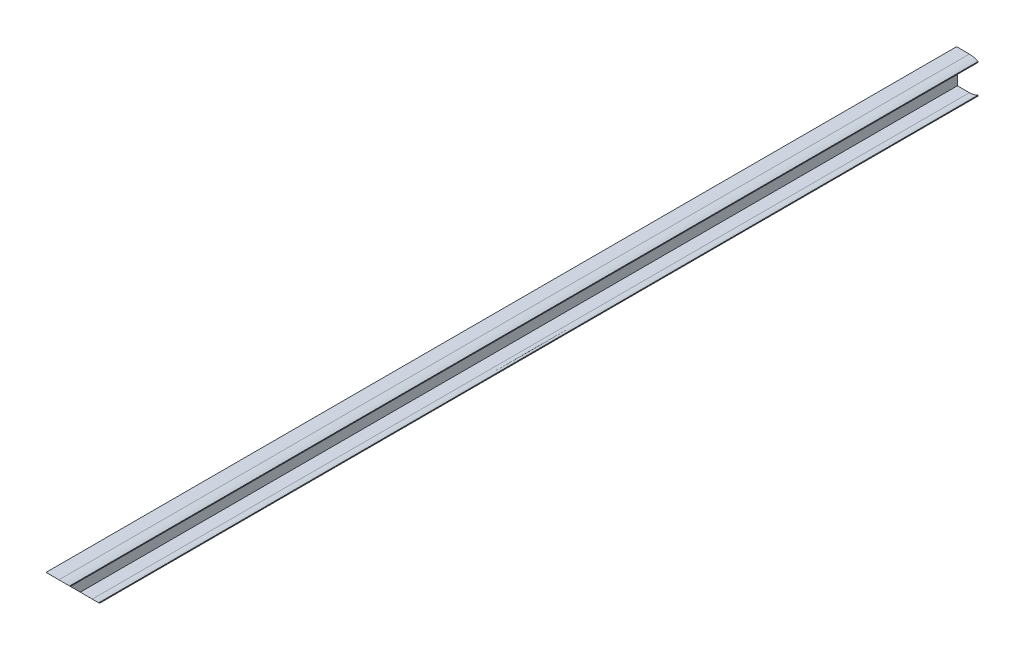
from build123d import *

# Parameters (mm, degrees)
EXTRUSION1_DEPTH = 2125
EXTRUSION5_REACH = 2129.093


with BuildPart() as part:
    # Esquisse1 → Extrusion1 (new body)
    with BuildSketch(Plane.XY):
        with BuildLine():
            Line((0, 0), (0, 80))
            Line((0, 80), (30, 80))
            add(Edge.make_bspline(
                [(30, 80), (40.603281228, 79.951543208), (50, 75)],
                knots=[0, 0, 0, 1, 1, 1], degree=2))
            Line((50, 75), (50, 73))
            add(Edge.make_bspline(
                [(30, 78), (40.603281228, 77.951543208), (50, 73)],
                knots=[0, 0, 0, 1, 1, 1], degree=2))
            Line((30, 78), (2, 78))
            Line((2, 78), (2, 2))
            Line((2, 2), (30, 2))
            add(Edge.make_bspline(
                [(30, 2), (40.603281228, 2.048456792), (50, 7)],
                knots=[0, 0, 0, 1, 1, 1], degree=2))
            Line((50, 7), (50, 5))
            add(Edge.make_bspline(
                [(30, 0), (40.603281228, 0.048456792), (50, 5)],
                knots=[0, 0, 0, 1, 1, 1], degree=2))
            Line((30, 0), (0, 0))
        make_face()
    extrude(amount=EXTRUSION1_DEPTH)

    # Esquisse4 → Extrusion5 (cut, up to next)
    with BuildSketch(Plane.ZY, mode=Mode.PRIVATE) as extrusion5_sk1:
        Polygon((2125, 80), (2045, 0), (2125, 0), align=None)
    extrusion5_tool1 = extrude(extrusion5_sk1.sketch, amount=-EXTRUSION5_REACH, mode=Mode.PRIVATE) & part.part
    add(extrusion5_tool1.solids().sort_by_distance((0, 26.666667, 2098.333333))[0], mode=Mode.SUBTRACT)


solid = part.part
